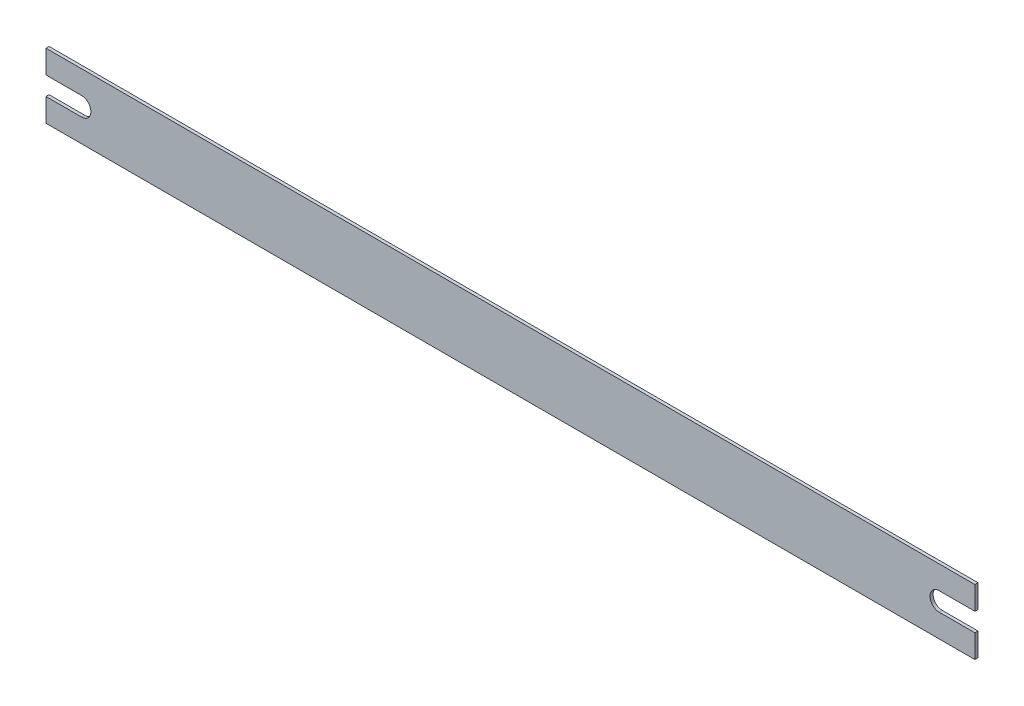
from build123d import *

# Parameters (mm, degrees)
LINEAR_AUSTRAGEN1_DEPTH = 5


with BuildPart() as part:
    # Skizze1 → Linear austragen1 (new body)
    with BuildSketch(Plane.XY):
        with BuildLine():
            Line((57.5, 37.5), (0, 37.5))
            Line((0, 37.5), (0, 0))
            Line((0, 0), (1500, 0))
            Line((1500, 0), (1500, 37.5))
            Line((1500, 37.5), (1442.5, 37.5))
            ThreePointArc((1442.5, 37.5), (1431.893398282, 41.893398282), (1427.5, 52.5))
            Line((1427.5, 52.5), (72.5, 52.5))
            ThreePointArc((72.5, 52.5), (68.106601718, 41.893398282), (57.5, 37.5))
        make_face()
        with BuildLine():
            ThreePointArc((57.5, 67.5), (68.106601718, 63.106601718), (72.5, 52.5))
            Line((72.5, 52.5), (1427.5, 52.5))
            ThreePointArc((1427.5, 52.5), (1431.893398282, 63.106601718), (1442.5, 67.5))
            Line((1442.5, 67.5), (1500, 67.5))
            Line((1500, 67.5), (1500, 105))
            Line((1500, 105), (0, 105))
            Line((0, 105), (0, 67.5))
            Line((0, 67.5), (57.5, 67.5))
        make_face()
    extrude(amount=LINEAR_AUSTRAGEN1_DEPTH)


solid = part.part
